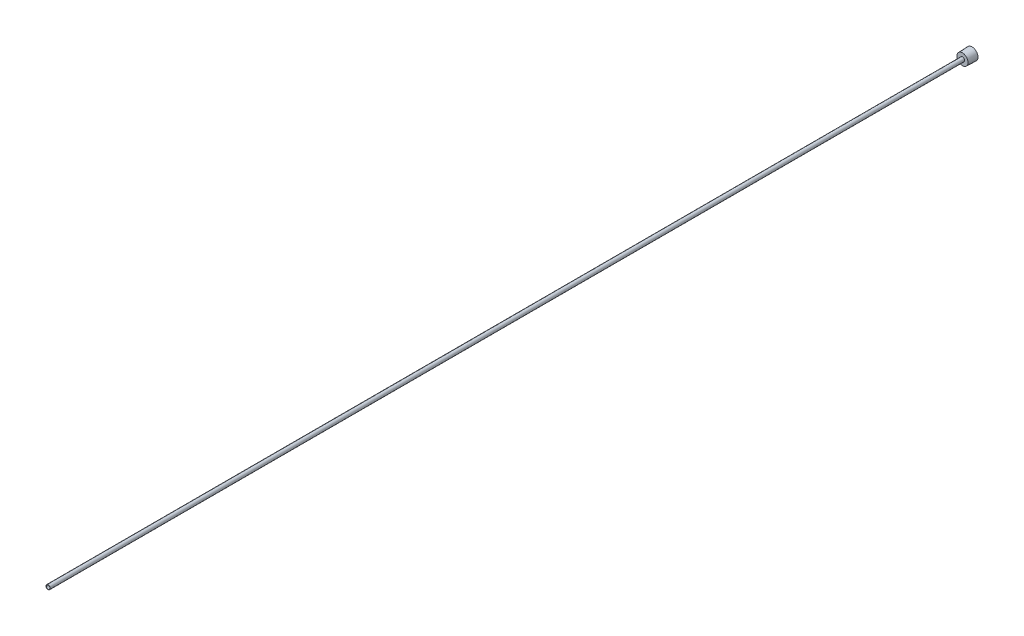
from build123d import *

# Parameters (mm, degrees)
SKETCH2_R          = 1.2065
CUT_EXTRUDE1_DEPTH = 610.624936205
CUT_EXTRUDE2_DEPTH = 3.96875


with BuildPart() as part:
    # Sketch1 → Revolve1 (revolve)
    with BuildSketch(Plane(origin=(0, 0, 0), x_dir=(0, 0, -1), z_dir=(1, 0, 0)), mode=Mode.PRIVATE) as revolve1_sk:
        Polygon((-609.6, 0), (0, 0), (0, 3.8989), (-6.35, 3.667387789), (-6.35, 1.3890625), (-609.6, 1.3890625), align=None)
    revolve(revolve1_sk.sketch.rotate(Axis((0, 0, 0), (0, 0, -1)), 90), axis=Axis((0, 0, 0), (0, 0, -1)))

    # Sketch2 → Cut-Extrude1 (cut, through all)
    with BuildSketch(Plane.XY.offset(609.6)):
        Circle(SKETCH2_R)
    extrude(amount=-CUT_EXTRUDE1_DEPTH, mode=Mode.SUBTRACT)

    # Sketch3 → Cut-Extrude2 (cut)
    with BuildSketch(Plane(origin=(0, 0, 0), x_dir=(-1, 0, 0), z_dir=(0, 0, -1))):
        Polygon((0, -2.756963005), (2.3876, -1.378481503), (2.3876, 1.378481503), (0, 2.756963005), (-2.3876, 1.378481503), (-2.3876, -1.378481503), align=None)
    extrude(amount=-CUT_EXTRUDE2_DEPTH, mode=Mode.SUBTRACT)


solid = part.part
